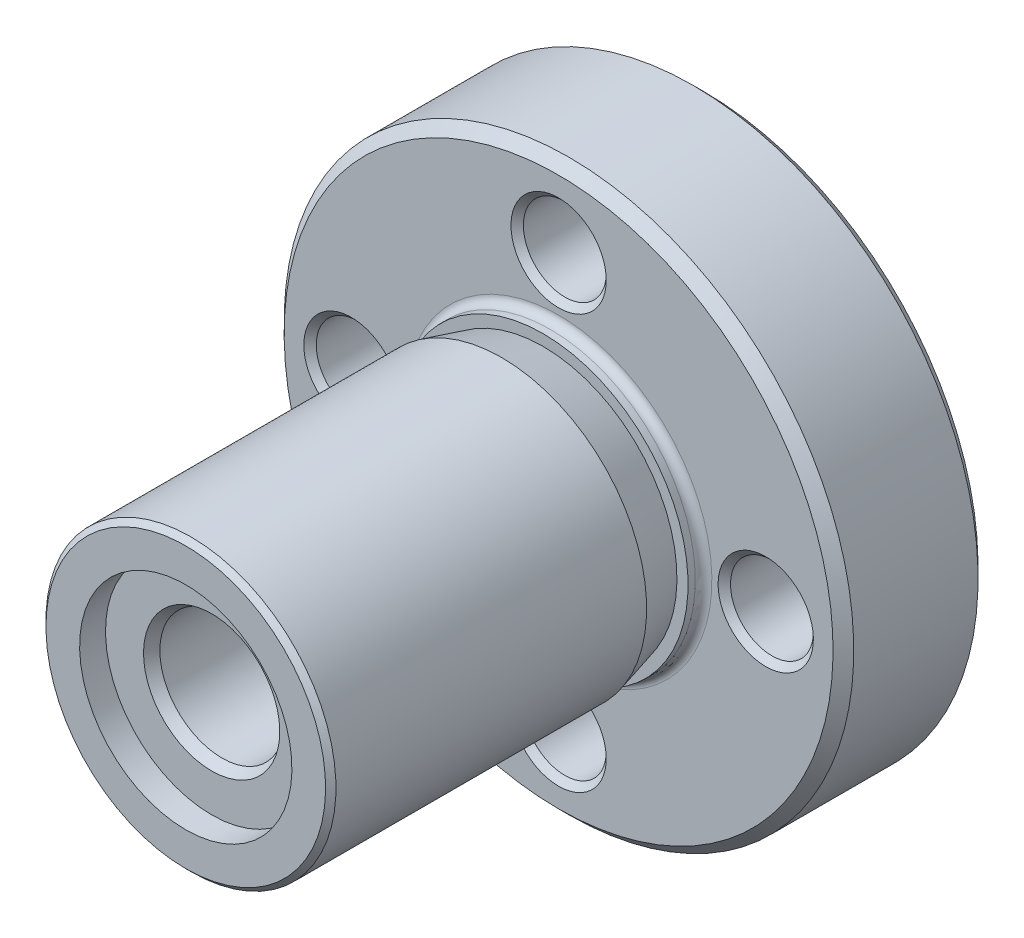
ISO-10303-21;
HEADER;
FILE_DESCRIPTION(('STEP AP214'),'2;1');
FILE_NAME('part.step','',(''),(''),'','','');
FILE_SCHEMA(('AUTOMOTIVE_DESIGN { 1 0 10303 214 1 1 1 1 }'));
ENDSEC;
DATA;
#1=APPLICATION_CONTEXT('core data for automotive mechanical design processes');
#2=APPLICATION_PROTOCOL_DEFINITION('international standard','automotive_design',2000,#1);
#3=PRODUCT_CONTEXT('',#1,'mechanical');
#4=PRODUCT('Part','Part','',(#3));
#5=PRODUCT_RELATED_PRODUCT_CATEGORY('part','',(#4));
#6=PRODUCT_DEFINITION_FORMATION('','',#4);
#7=PRODUCT_DEFINITION_CONTEXT('part definition',#1,'design');
#8=PRODUCT_DEFINITION('design','',#6,#7);
#9=PRODUCT_DEFINITION_SHAPE('','',#8);
#10=(LENGTH_UNIT() NAMED_UNIT(*) SI_UNIT(.MILLI.,.METRE.));
#11=(NAMED_UNIT(*) PLANE_ANGLE_UNIT() SI_UNIT($,.RADIAN.));
#12=(NAMED_UNIT(*) SI_UNIT($,.STERADIAN.) SOLID_ANGLE_UNIT());
#13=UNCERTAINTY_MEASURE_WITH_UNIT(LENGTH_MEASURE(1.E-05),#10,'distance_accuracy_value','');
#14=(GEOMETRIC_REPRESENTATION_CONTEXT(3) GLOBAL_UNCERTAINTY_ASSIGNED_CONTEXT((#13)) GLOBAL_UNIT_ASSIGNED_CONTEXT((#10,
#11,#12)) REPRESENTATION_CONTEXT('',''));
#15=CARTESIAN_POINT('',(0.,0.,0.));
#16=DIRECTION('',(0.,0.,1.));
#17=DIRECTION('',(1.,0.,0.));
#18=AXIS2_PLACEMENT_3D('',#15,#16,#17);
#19=CARTESIAN_POINT('',(0.,0.,0.));
#20=DIRECTION('',(0.,0.,-1.));
#21=DIRECTION('',(0.,1.,0.));
#22=AXIS2_PLACEMENT_3D('',#19,#20,#21);
#23=CYLINDRICAL_SURFACE('',#22,6.);
#24=CARTESIAN_POINT('',(0.,0.,1.));
#25=DIRECTION('',(0.,0.,-1.));
#26=DIRECTION('',(0.,1.,0.));
#27=AXIS2_PLACEMENT_3D('',#24,#25,#26);
#28=CIRCLE('',#27,6.);
#29=CARTESIAN_POINT('',(0.,6.,1.));
#30=VERTEX_POINT('',#29);
#31=EDGE_CURVE('E98',#30,#30,#28,.T.);
#32=ORIENTED_EDGE('',*,*,#31,.T.);
#33=EDGE_LOOP('',(#32));
#34=FACE_BOUND('',#33,.T.);
#35=CARTESIAN_POINT('',(0.,0.,46.5));
#36=DIRECTION('',(0.,0.,1.));
#37=DIRECTION('',(0.,-1.,0.));
#38=AXIS2_PLACEMENT_3D('',#35,#36,#37);
#39=CIRCLE('',#38,6.);
#40=CARTESIAN_POINT('',(0.,-6.,46.5));
#41=VERTEX_POINT('',#40);
#42=EDGE_CURVE('E110',#41,#41,#39,.T.);
#43=ORIENTED_EDGE('',*,*,#42,.T.);
#44=EDGE_LOOP('',(#43));
#45=FACE_BOUND('',#44,.T.);
#46=ADVANCED_FACE('F12',(#34,#45),#23,.F.);
#47=CARTESIAN_POINT('',(0.,0.,0.));
#48=DIRECTION('',(0.,0.,-1.));
#49=DIRECTION('',(0.,1.,0.));
#50=AXIS2_PLACEMENT_3D('',#47,#48,#49);
#51=CYLINDRICAL_SURFACE('',#50,14.);
#52=CARTESIAN_POINT('',(0.,0.,14.8));
#53=DIRECTION('',(0.,0.,1.));
#54=DIRECTION('',(0.,-1.,0.));
#55=AXIS2_PLACEMENT_3D('',#52,#53,#54);
#56=CIRCLE('',#55,14.);
#57=CARTESIAN_POINT('',(0.,-14.,14.8));
#58=VERTEX_POINT('',#57);
#59=EDGE_CURVE('E107',#58,#58,#56,.T.);
#60=ORIENTED_EDGE('',*,*,#59,.T.);
#61=EDGE_LOOP('',(#60));
#62=FACE_BOUND('',#61,.T.);
#63=CARTESIAN_POINT('',(0.,0.,15.5));
#64=DIRECTION('',(0.,0.,-1.));
#65=DIRECTION('',(0.,1.,0.));
#66=AXIS2_PLACEMENT_3D('',#63,#64,#65);
#67=CIRCLE('',#66,14.);
#68=CARTESIAN_POINT('',(0.,14.,15.5));
#69=VERTEX_POINT('',#68);
#70=EDGE_CURVE('E77',#69,#69,#67,.T.);
#71=ORIENTED_EDGE('',*,*,#70,.T.);
#72=EDGE_LOOP('',(#71));
#73=FACE_BOUND('',#72,.T.);
#74=ADVANCED_FACE('F144',(#62,#73),#51,.T.);
#75=CARTESIAN_POINT('',(0.,0.,49.5));
#76=DIRECTION('',(0.,0.,1.));
#77=DIRECTION('',(0.,-1.,0.));
#78=AXIS2_PLACEMENT_3D('',#75,#76,#77);
#79=CIRCLE('',#78,14.);
#80=CARTESIAN_POINT('',(0.,-14.,49.5));
#81=VERTEX_POINT('',#80);
#82=EDGE_CURVE('E92',#81,#81,#79,.F.);
#83=ORIENTED_EDGE('',*,*,#82,.T.);
#84=EDGE_LOOP('',(#83));
#85=FACE_BOUND('',#84,.T.);
#86=CARTESIAN_POINT('',(0.,0.,19.5));
#87=DIRECTION('',(0.,0.,-1.));
#88=DIRECTION('',(0.,1.,0.));
#89=AXIS2_PLACEMENT_3D('',#86,#87,#88);
#90=CIRCLE('',#89,14.);
#91=CARTESIAN_POINT('',(0.,14.,19.5));
#92=VERTEX_POINT('',#91);
#93=EDGE_CURVE('E74',#92,#92,#90,.T.);
#94=ORIENTED_EDGE('',*,*,#93,.F.);
#95=EDGE_LOOP('',(#94));
#96=FACE_BOUND('',#95,.T.);
#97=ADVANCED_FACE('F150',(#85,#96),#51,.T.);
#98=CARTESIAN_POINT('',(6.,0.,0.));
#99=DIRECTION('',(0.,0.,-1.));
#100=DIRECTION('',(0.,1.,0.));
#101=AXIS2_PLACEMENT_3D('',#98,#99,#100);
#102=PLANE('',#101);
#103=CARTESIAN_POINT('',(0.,0.,0.));
#104=DIRECTION('',(0.,0.,-1.));
#105=DIRECTION('',(0.,1.,0.));
#106=AXIS2_PLACEMENT_3D('',#103,#104,#105);
#107=CIRCLE('',#106,6.57735026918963);
#108=CARTESIAN_POINT('',(0.,6.57735026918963,0.));
#109=VERTEX_POINT('',#108);
#110=EDGE_CURVE('E101',#109,#109,#107,.F.);
#111=ORIENTED_EDGE('',*,*,#110,.T.);
#112=EDGE_LOOP('',(#111));
#113=FACE_BOUND('',#112,.T.);
#114=CARTESIAN_POINT('',(0.,0.,0.));
#115=DIRECTION('',(0.,0.,-1.));
#116=DIRECTION('',(0.,1.,0.));
#117=AXIS2_PLACEMENT_3D('',#114,#115,#116);
#118=CIRCLE('',#117,26.5);
#119=CARTESIAN_POINT('',(0.,26.5,0.));
#120=VERTEX_POINT('',#119);
#121=EDGE_CURVE('E89',#120,#120,#118,.T.);
#122=ORIENTED_EDGE('',*,*,#121,.T.);
#123=EDGE_LOOP('',(#122));
#124=FACE_BOUND('',#123,.T.);
#125=CARTESIAN_POINT('',(20.,0.,0.));
#126=DIRECTION('',(0.,0.,-1.));
#127=DIRECTION('',(0.,1.,0.));
#128=AXIS2_PLACEMENT_3D('',#125,#126,#127);
#129=CIRCLE('',#128,4.6);
#130=CARTESIAN_POINT('',(20.,4.6,0.));
#131=VERTEX_POINT('',#130);
#132=EDGE_CURVE('E59',#131,#131,#129,.T.);
#133=ORIENTED_EDGE('',*,*,#132,.F.);
#134=EDGE_LOOP('',(#133));
#135=FACE_BOUND('',#134,.T.);
#136=CARTESIAN_POINT('',(0.,-20.,0.));
#137=DIRECTION('',(0.,0.,-1.));
#138=DIRECTION('',(0.,1.,0.));
#139=AXIS2_PLACEMENT_3D('',#136,#137,#138);
#140=CIRCLE('',#139,4.6);
#141=CARTESIAN_POINT('',(0.,-15.4,0.));
#142=VERTEX_POINT('',#141);
#143=EDGE_CURVE('E62',#142,#142,#140,.T.);
#144=ORIENTED_EDGE('',*,*,#143,.F.);
#145=EDGE_LOOP('',(#144));
#146=FACE_BOUND('',#145,.T.);
#147=CARTESIAN_POINT('',(-20.,0.,0.));
#148=DIRECTION('',(0.,0.,-1.));
#149=DIRECTION('',(0.,1.,0.));
#150=AXIS2_PLACEMENT_3D('',#147,#148,#149);
#151=CIRCLE('',#150,4.6);
#152=CARTESIAN_POINT('',(-20.,4.6,0.));
#153=VERTEX_POINT('',#152);
#154=EDGE_CURVE('E65',#153,#153,#151,.T.);
#155=ORIENTED_EDGE('',*,*,#154,.F.);
#156=EDGE_LOOP('',(#155));
#157=FACE_BOUND('',#156,.T.);
#158=CARTESIAN_POINT('',(0.,20.,0.));
#159=DIRECTION('',(0.,0.,-1.));
#160=DIRECTION('',(0.,1.,0.));
#161=AXIS2_PLACEMENT_3D('',#158,#159,#160);
#162=CIRCLE('',#161,4.6);
#163=CARTESIAN_POINT('',(0.,24.6,0.));
#164=VERTEX_POINT('',#163);
#165=EDGE_CURVE('E68',#164,#164,#162,.T.);
#166=ORIENTED_EDGE('',*,*,#165,.F.);
#167=EDGE_LOOP('',(#166));
#168=FACE_BOUND('',#167,.T.);
#169=ADVANCED_FACE('F228',(#113,#124,#135,#146,#157,#168),#102,.T.);
#170=CARTESIAN_POINT('',(0.,0.,0.));
#171=DIRECTION('',(0.,0.,-1.));
#172=DIRECTION('',(0.,1.,0.));
#173=AXIS2_PLACEMENT_3D('',#170,#171,#172);
#174=CYLINDRICAL_SURFACE('',#173,27.5);
#175=CARTESIAN_POINT('',(0.,0.,13.));
#176=DIRECTION('',(0.,0.,1.));
#177=DIRECTION('',(0.,-1.,0.));
#178=AXIS2_PLACEMENT_3D('',#175,#176,#177);
#179=CIRCLE('',#178,27.5);
#180=CARTESIAN_POINT('',(0.,-27.5,13.));
#181=VERTEX_POINT('',#180);
#182=EDGE_CURVE('E83',#181,#181,#179,.F.);
#183=ORIENTED_EDGE('',*,*,#182,.T.);
#184=EDGE_LOOP('',(#183));
#185=FACE_BOUND('',#184,.T.);
#186=CARTESIAN_POINT('',(0.,0.,1.));
#187=DIRECTION('',(0.,0.,-1.));
#188=DIRECTION('',(0.,1.,0.));
#189=AXIS2_PLACEMENT_3D('',#186,#187,#188);
#190=CIRCLE('',#189,27.5);
#191=CARTESIAN_POINT('',(0.,27.5,1.));
#192=VERTEX_POINT('',#191);
#193=EDGE_CURVE('E80',#192,#192,#190,.F.);
#194=ORIENTED_EDGE('',*,*,#193,.T.);
#195=EDGE_LOOP('',(#194));
#196=FACE_BOUND('',#195,.T.);
#197=ADVANCED_FACE('F226',(#185,#196),#174,.T.);
#198=CARTESIAN_POINT('',(14.,0.,14.));
#199=DIRECTION('',(0.,0.,1.));
#200=DIRECTION('',(0.,-1.,0.));
#201=AXIS2_PLACEMENT_3D('',#198,#199,#200);
#202=PLANE('',#201);
#203=CARTESIAN_POINT('',(-20.,0.,14.));
#204=DIRECTION('',(0.,0.,1.));
#205=DIRECTION('',(0.,-1.,0.));
#206=AXIS2_PLACEMENT_3D('',#203,#204,#205);
#207=CIRCLE('',#206,4.6);
#208=CARTESIAN_POINT('',(-20.,-4.6,14.));
#209=VERTEX_POINT('',#208);
#210=EDGE_CURVE('E8',#209,#209,#207,.F.);
#211=ORIENTED_EDGE('',*,*,#210,.T.);
#212=EDGE_LOOP('',(#211));
#213=FACE_BOUND('',#212,.T.);
#214=CARTESIAN_POINT('',(20.,0.,14.));
#215=DIRECTION('',(0.,0.,1.));
#216=DIRECTION('',(0.,-1.,0.));
#217=AXIS2_PLACEMENT_3D('',#214,#215,#216);
#218=CIRCLE('',#217,4.6);
#219=CARTESIAN_POINT('',(20.,-4.6,14.));
#220=VERTEX_POINT('',#219);
#221=EDGE_CURVE('E19',#220,#220,#218,.F.);
#222=ORIENTED_EDGE('',*,*,#221,.T.);
#223=EDGE_LOOP('',(#222));
#224=FACE_BOUND('',#223,.T.);
#225=CARTESIAN_POINT('',(0.,20.,14.));
#226=DIRECTION('',(0.,0.,1.));
#227=DIRECTION('',(0.,-1.,0.));
#228=AXIS2_PLACEMENT_3D('',#225,#226,#227);
#229=CIRCLE('',#228,4.6);
#230=CARTESIAN_POINT('',(0.,15.4,14.));
#231=VERTEX_POINT('',#230);
#232=EDGE_CURVE('E24',#231,#231,#229,.F.);
#233=ORIENTED_EDGE('',*,*,#232,.T.);
#234=EDGE_LOOP('',(#233));
#235=FACE_BOUND('',#234,.T.);
#236=CARTESIAN_POINT('',(0.,-20.,14.));
#237=DIRECTION('',(0.,0.,1.));
#238=DIRECTION('',(0.,-1.,0.));
#239=AXIS2_PLACEMENT_3D('',#236,#237,#238);
#240=CIRCLE('',#239,4.6);
#241=CARTESIAN_POINT('',(0.,-24.6,14.));
#242=VERTEX_POINT('',#241);
#243=EDGE_CURVE('E116',#242,#242,#240,.F.);
#244=ORIENTED_EDGE('',*,*,#243,.T.);
#245=EDGE_LOOP('',(#244));
#246=FACE_BOUND('',#245,.T.);
#247=CARTESIAN_POINT('',(0.,0.,14.));
#248=DIRECTION('',(0.,0.,1.));
#249=DIRECTION('',(0.,-1.,0.));
#250=AXIS2_PLACEMENT_3D('',#247,#248,#249);
#251=CIRCLE('',#250,14.8);
#252=CARTESIAN_POINT('',(0.,-14.8,14.));
#253=VERTEX_POINT('',#252);
#254=EDGE_CURVE('E104',#253,#253,#251,.F.);
#255=ORIENTED_EDGE('',*,*,#254,.T.);
#256=EDGE_LOOP('',(#255));
#257=FACE_BOUND('',#256,.T.);
#258=CARTESIAN_POINT('',(0.,0.,14.));
#259=DIRECTION('',(0.,0.,1.));
#260=DIRECTION('',(0.,-1.,0.));
#261=AXIS2_PLACEMENT_3D('',#258,#259,#260);
#262=CIRCLE('',#261,26.5);
#263=CARTESIAN_POINT('',(0.,-26.5,14.));
#264=VERTEX_POINT('',#263);
#265=EDGE_CURVE('E86',#264,#264,#262,.T.);
#266=ORIENTED_EDGE('',*,*,#265,.T.);
#267=EDGE_LOOP('',(#266));
#268=FACE_BOUND('',#267,.T.);
#269=ADVANCED_FACE('F121',(#213,#224,#235,#246,#257,#268),#202,.T.);
#270=CARTESIAN_POINT('',(6.,0.,50.));
#271=DIRECTION('',(0.,0.,1.));
#272=DIRECTION('',(0.,-1.,0.));
#273=AXIS2_PLACEMENT_3D('',#270,#271,#272);
#274=PLANE('',#273);
#275=CARTESIAN_POINT('',(0.,0.,50.));
#276=DIRECTION('',(0.,0.,1.));
#277=DIRECTION('',(0.,-1.,0.));
#278=AXIS2_PLACEMENT_3D('',#275,#276,#277);
#279=CIRCLE('',#278,13.5);
#280=CARTESIAN_POINT('',(0.,-13.5,50.));
#281=VERTEX_POINT('',#280);
#282=EDGE_CURVE('E95',#281,#281,#279,.T.);
#283=ORIENTED_EDGE('',*,*,#282,.T.);
#284=EDGE_LOOP('',(#283));
#285=FACE_BOUND('',#284,.T.);
#286=CARTESIAN_POINT('',(0.,0.,50.));
#287=DIRECTION('',(0.,0.,1.));
#288=DIRECTION('',(0.,-1.,0.));
#289=AXIS2_PLACEMENT_3D('',#286,#287,#288);
#290=CIRCLE('',#289,10.25);
#291=CARTESIAN_POINT('',(0.,-10.25,50.));
#292=VERTEX_POINT('',#291);
#293=EDGE_CURVE('E53',#292,#292,#290,.T.);
#294=ORIENTED_EDGE('',*,*,#293,.F.);
#295=EDGE_LOOP('',(#294));
#296=FACE_BOUND('',#295,.T.);
#297=ADVANCED_FACE('F219',(#285,#296),#274,.T.);
#298=CARTESIAN_POINT('',(-14.,0.,15.5));
#299=DIRECTION('',(0.,0.,1.));
#300=DIRECTION('',(0.,-1.,0.));
#301=AXIS2_PLACEMENT_3D('',#298,#299,#300);
#302=PLANE('',#301);
#303=CARTESIAN_POINT('',(0.,0.,15.5));
#304=DIRECTION('',(0.,0.,-1.));
#305=DIRECTION('',(0.,1.,0.));
#306=AXIS2_PLACEMENT_3D('',#303,#304,#305);
#307=CIRCLE('',#306,12.9282032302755);
#308=CARTESIAN_POINT('',(0.,12.9282032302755,15.5));
#309=VERTEX_POINT('',#308);
#310=EDGE_CURVE('E71',#309,#309,#307,.T.);
#311=ORIENTED_EDGE('',*,*,#310,.T.);
#312=EDGE_LOOP('',(#311));
#313=FACE_BOUND('',#312,.T.);
#314=ORIENTED_EDGE('',*,*,#70,.F.);
#315=EDGE_LOOP('',(#314));
#316=FACE_BOUND('',#315,.T.);
#317=ADVANCED_FACE('F215',(#313,#316),#302,.T.);
#318=CARTESIAN_POINT('',(0.,0.,15.5));
#319=DIRECTION('',(0.,0.,1.));
#320=DIRECTION('',(0.,-1.,0.));
#321=AXIS2_PLACEMENT_3D('',#318,#319,#320);
#322=CONICAL_SURFACE('',#321,12.9282032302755,0.261799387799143);
#323=ORIENTED_EDGE('',*,*,#310,.F.);
#324=EDGE_LOOP('',(#323));
#325=FACE_BOUND('',#324,.T.);
#326=ORIENTED_EDGE('',*,*,#93,.T.);
#327=EDGE_LOOP('',(#326));
#328=FACE_BOUND('',#327,.T.);
#329=ADVANCED_FACE('F212',(#325,#328),#322,.T.);
#330=CARTESIAN_POINT('',(0.,20.,0.));
#331=DIRECTION('',(0.,0.,-1.));
#332=DIRECTION('',(0.,1.,0.));
#333=AXIS2_PLACEMENT_3D('',#330,#331,#332);
#334=CONICAL_SURFACE('',#333,4.6,0.785398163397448);
#335=CARTESIAN_POINT('',(0.,20.,0.6));
#336=DIRECTION('',(0.,0.,-1.));
#337=DIRECTION('',(0.,1.,0.));
#338=AXIS2_PLACEMENT_3D('',#335,#336,#337);
#339=CIRCLE('',#338,4.);
#340=CARTESIAN_POINT('',(0.,24.,0.6));
#341=VERTEX_POINT('',#340);
#342=EDGE_CURVE('E38',#341,#341,#339,.F.);
#343=ORIENTED_EDGE('',*,*,#342,.T.);
#344=EDGE_LOOP('',(#343));
#345=FACE_BOUND('',#344,.T.);
#346=ORIENTED_EDGE('',*,*,#165,.T.);
#347=EDGE_LOOP('',(#346));
#348=FACE_BOUND('',#347,.T.);
#349=ADVANCED_FACE('F208',(#345,#348),#334,.F.);
#350=CARTESIAN_POINT('',(-20.,0.,0.));
#351=DIRECTION('',(0.,0.,-1.));
#352=DIRECTION('',(0.,1.,0.));
#353=AXIS2_PLACEMENT_3D('',#350,#351,#352);
#354=CONICAL_SURFACE('',#353,4.6,0.785398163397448);
#355=CARTESIAN_POINT('',(-20.,0.,0.6));
#356=DIRECTION('',(0.,0.,-1.));
#357=DIRECTION('',(0.,1.,0.));
#358=AXIS2_PLACEMENT_3D('',#355,#356,#357);
#359=CIRCLE('',#358,4.);
#360=CARTESIAN_POINT('',(-20.,4.,0.6));
#361=VERTEX_POINT('',#360);
#362=EDGE_CURVE('E31',#361,#361,#359,.F.);
#363=ORIENTED_EDGE('',*,*,#362,.T.);
#364=EDGE_LOOP('',(#363));
#365=FACE_BOUND('',#364,.T.);
#366=ORIENTED_EDGE('',*,*,#154,.T.);
#367=EDGE_LOOP('',(#366));
#368=FACE_BOUND('',#367,.T.);
#369=ADVANCED_FACE('F204',(#365,#368),#354,.F.);
#370=CARTESIAN_POINT('',(0.,-20.,0.));
#371=DIRECTION('',(0.,0.,-1.));
#372=DIRECTION('',(0.,1.,0.));
#373=AXIS2_PLACEMENT_3D('',#370,#371,#372);
#374=CONICAL_SURFACE('',#373,4.6,0.785398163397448);
#375=CARTESIAN_POINT('',(0.,-20.,0.6));
#376=DIRECTION('',(0.,0.,-1.));
#377=DIRECTION('',(0.,1.,0.));
#378=AXIS2_PLACEMENT_3D('',#375,#376,#377);
#379=CIRCLE('',#378,4.);
#380=CARTESIAN_POINT('',(0.,-16.,0.6));
#381=VERTEX_POINT('',#380);
#382=EDGE_CURVE('E32',#381,#381,#379,.F.);
#383=ORIENTED_EDGE('',*,*,#382,.T.);
#384=EDGE_LOOP('',(#383));
#385=FACE_BOUND('',#384,.T.);
#386=ORIENTED_EDGE('',*,*,#143,.T.);
#387=EDGE_LOOP('',(#386));
#388=FACE_BOUND('',#387,.T.);
#389=ADVANCED_FACE('F200',(#385,#388),#374,.F.);
#390=CARTESIAN_POINT('',(20.,0.,0.));
#391=DIRECTION('',(0.,0.,-1.));
#392=DIRECTION('',(0.,1.,0.));
#393=AXIS2_PLACEMENT_3D('',#390,#391,#392);
#394=CONICAL_SURFACE('',#393,4.6,0.785398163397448);
#395=CARTESIAN_POINT('',(20.,0.,0.6));
#396=DIRECTION('',(0.,0.,-1.));
#397=DIRECTION('',(0.,1.,0.));
#398=AXIS2_PLACEMENT_3D('',#395,#396,#397);
#399=CIRCLE('',#398,4.);
#400=CARTESIAN_POINT('',(20.,4.,0.6));
#401=VERTEX_POINT('',#400);
#402=EDGE_CURVE('E35',#401,#401,#399,.F.);
#403=ORIENTED_EDGE('',*,*,#402,.T.);
#404=EDGE_LOOP('',(#403));
#405=FACE_BOUND('',#404,.T.);
#406=ORIENTED_EDGE('',*,*,#132,.T.);
#407=EDGE_LOOP('',(#406));
#408=FACE_BOUND('',#407,.T.);
#409=ADVANCED_FACE('F196',(#405,#408),#394,.F.);
#410=CARTESIAN_POINT('',(0.,0.,47.5));
#411=DIRECTION('',(0.,0.,1.));
#412=DIRECTION('',(0.,-1.,0.));
#413=AXIS2_PLACEMENT_3D('',#410,#411,#412);
#414=CYLINDRICAL_SURFACE('',#413,10.25);
#415=CARTESIAN_POINT('',(0.,0.,47.5));
#416=DIRECTION('',(0.,0.,1.));
#417=DIRECTION('',(0.,-1.,0.));
#418=AXIS2_PLACEMENT_3D('',#415,#416,#417);
#419=CIRCLE('',#418,10.25);
#420=CARTESIAN_POINT('',(0.,-10.25,47.5));
#421=VERTEX_POINT('',#420);
#422=EDGE_CURVE('E56',#421,#421,#419,.T.);
#423=ORIENTED_EDGE('',*,*,#422,.F.);
#424=EDGE_LOOP('',(#423));
#425=FACE_BOUND('',#424,.T.);
#426=ORIENTED_EDGE('',*,*,#293,.T.);
#427=EDGE_LOOP('',(#426));
#428=FACE_BOUND('',#427,.T.);
#429=ADVANCED_FACE('F192',(#425,#428),#414,.F.);
#430=CARTESIAN_POINT('',(0.,0.,47.5));
#431=DIRECTION('',(0.,0.,1.));
#432=DIRECTION('',(0.,-1.,0.));
#433=AXIS2_PLACEMENT_3D('',#430,#431,#432);
#434=PLANE('',#433);
#435=CARTESIAN_POINT('',(0.,0.,47.5));
#436=DIRECTION('',(0.,0.,1.));
#437=DIRECTION('',(0.,-1.,0.));
#438=AXIS2_PLACEMENT_3D('',#435,#436,#437);
#439=CIRCLE('',#438,6.57735026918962);
#440=CARTESIAN_POINT('',(0.,-6.57735026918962,47.5));
#441=VERTEX_POINT('',#440);
#442=EDGE_CURVE('E113',#441,#441,#439,.F.);
#443=ORIENTED_EDGE('',*,*,#442,.T.);
#444=EDGE_LOOP('',(#443));
#445=FACE_BOUND('',#444,.T.);
#446=ORIENTED_EDGE('',*,*,#422,.T.);
#447=EDGE_LOOP('',(#446));
#448=FACE_BOUND('',#447,.T.);
#449=ADVANCED_FACE('F188',(#445,#448),#434,.T.);
#450=CARTESIAN_POINT('',(0.,0.,13.));
#451=DIRECTION('',(0.,0.,-1.));
#452=DIRECTION('',(0.,1.,0.));
#453=AXIS2_PLACEMENT_3D('',#450,#451,#452);
#454=CONICAL_SURFACE('',#453,27.5,0.785398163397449);
#455=ORIENTED_EDGE('',*,*,#265,.F.);
#456=EDGE_LOOP('',(#455));
#457=FACE_BOUND('',#456,.T.);
#458=ORIENTED_EDGE('',*,*,#182,.F.);
#459=EDGE_LOOP('',(#458));
#460=FACE_BOUND('',#459,.T.);
#461=ADVANCED_FACE('F184',(#457,#460),#454,.T.);
#462=CARTESIAN_POINT('',(0.,0.,0.));
#463=DIRECTION('',(0.,0.,1.));
#464=DIRECTION('',(0.,-1.,0.));
#465=AXIS2_PLACEMENT_3D('',#462,#463,#464);
#466=CONICAL_SURFACE('',#465,26.5,0.785398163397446);
#467=ORIENTED_EDGE('',*,*,#193,.F.);
#468=EDGE_LOOP('',(#467));
#469=FACE_BOUND('',#468,.T.);
#470=ORIENTED_EDGE('',*,*,#121,.F.);
#471=EDGE_LOOP('',(#470));
#472=FACE_BOUND('',#471,.T.);
#473=ADVANCED_FACE('F180',(#469,#472),#466,.T.);
#474=CARTESIAN_POINT('',(0.,0.,49.5));
#475=DIRECTION('',(0.,0.,-1.));
#476=DIRECTION('',(0.,1.,0.));
#477=AXIS2_PLACEMENT_3D('',#474,#475,#476);
#478=CONICAL_SURFACE('',#477,14.,0.785398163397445);
#479=ORIENTED_EDGE('',*,*,#282,.F.);
#480=EDGE_LOOP('',(#479));
#481=FACE_BOUND('',#480,.T.);
#482=ORIENTED_EDGE('',*,*,#82,.F.);
#483=EDGE_LOOP('',(#482));
#484=FACE_BOUND('',#483,.T.);
#485=ADVANCED_FACE('F176',(#481,#484),#478,.T.);
#486=CARTESIAN_POINT('',(0.,0.,1.));
#487=DIRECTION('',(0.,0.,-1.));
#488=DIRECTION('',(0.,1.,0.));
#489=AXIS2_PLACEMENT_3D('',#486,#487,#488);
#490=CONICAL_SURFACE('',#489,6.,0.523598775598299);
#491=ORIENTED_EDGE('',*,*,#110,.F.);
#492=EDGE_LOOP('',(#491));
#493=FACE_BOUND('',#492,.T.);
#494=ORIENTED_EDGE('',*,*,#31,.F.);
#495=EDGE_LOOP('',(#494));
#496=FACE_BOUND('',#495,.T.);
#497=ADVANCED_FACE('F169',(#493,#496),#490,.F.);
#498=CARTESIAN_POINT('',(0.,0.,14.8));
#499=DIRECTION('',(0.,0.,1.));
#500=DIRECTION('',(0.,-1.,0.));
#501=AXIS2_PLACEMENT_3D('',#498,#499,#500);
#502=TOROIDAL_SURFACE('',#501,14.8,0.8);
#503=ORIENTED_EDGE('',*,*,#59,.F.);
#504=EDGE_LOOP('',(#503));
#505=FACE_BOUND('',#504,.T.);
#506=ORIENTED_EDGE('',*,*,#254,.F.);
#507=EDGE_LOOP('',(#506));
#508=FACE_BOUND('',#507,.T.);
#509=ADVANCED_FACE('F159',(#505,#508),#502,.F.);
#510=CARTESIAN_POINT('',(0.,0.,46.5));
#511=DIRECTION('',(0.,0.,1.));
#512=DIRECTION('',(0.,-1.,0.));
#513=AXIS2_PLACEMENT_3D('',#510,#511,#512);
#514=CONICAL_SURFACE('',#513,6.,0.523598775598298);
#515=ORIENTED_EDGE('',*,*,#442,.F.);
#516=EDGE_LOOP('',(#515));
#517=FACE_BOUND('',#516,.T.);
#518=ORIENTED_EDGE('',*,*,#42,.F.);
#519=EDGE_LOOP('',(#518));
#520=FACE_BOUND('',#519,.T.);
#521=ADVANCED_FACE('F157',(#517,#520),#514,.F.);
#522=CARTESIAN_POINT('',(-20.,0.,12.8));
#523=DIRECTION('',(0.,0.,1.));
#524=DIRECTION('',(0.,-1.,0.));
#525=AXIS2_PLACEMENT_3D('',#522,#523,#524);
#526=CONICAL_SURFACE('',#525,3.4,0.785398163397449);
#527=CARTESIAN_POINT('',(-20.,0.,13.4));
#528=DIRECTION('',(0.,0.,1.));
#529=DIRECTION('',(0.,-1.,0.));
#530=AXIS2_PLACEMENT_3D('',#527,#528,#529);
#531=CIRCLE('',#530,4.);
#532=CARTESIAN_POINT('',(-20.,-4.,13.4));
#533=VERTEX_POINT('',#532);
#534=EDGE_CURVE('E28',#533,#533,#531,.T.);
#535=ORIENTED_EDGE('',*,*,#534,.F.);
#536=EDGE_LOOP('',(#535));
#537=FACE_BOUND('',#536,.T.);
#538=ORIENTED_EDGE('',*,*,#210,.F.);
#539=EDGE_LOOP('',(#538));
#540=FACE_BOUND('',#539,.T.);
#541=ADVANCED_FACE('F139',(#537,#540),#526,.F.);
#542=CARTESIAN_POINT('',(20.,0.,12.8));
#543=DIRECTION('',(0.,0.,1.));
#544=DIRECTION('',(0.,-1.,0.));
#545=AXIS2_PLACEMENT_3D('',#542,#543,#544);
#546=CONICAL_SURFACE('',#545,3.4,0.785398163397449);
#547=CARTESIAN_POINT('',(20.,0.,13.4));
#548=DIRECTION('',(0.,0.,1.));
#549=DIRECTION('',(0.,-1.,0.));
#550=AXIS2_PLACEMENT_3D('',#547,#548,#549);
#551=CIRCLE('',#550,4.);
#552=CARTESIAN_POINT('',(20.,-4.,13.4));
#553=VERTEX_POINT('',#552);
#554=EDGE_CURVE('E36',#553,#553,#551,.T.);
#555=ORIENTED_EDGE('',*,*,#554,.F.);
#556=EDGE_LOOP('',(#555));
#557=FACE_BOUND('',#556,.T.);
#558=ORIENTED_EDGE('',*,*,#221,.F.);
#559=EDGE_LOOP('',(#558));
#560=FACE_BOUND('',#559,.T.);
#561=ADVANCED_FACE('F127',(#557,#560),#546,.F.);
#562=CARTESIAN_POINT('',(0.,20.,12.8));
#563=DIRECTION('',(0.,0.,1.));
#564=DIRECTION('',(0.,-1.,0.));
#565=AXIS2_PLACEMENT_3D('',#562,#563,#564);
#566=CONICAL_SURFACE('',#565,3.4,0.785398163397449);
#567=CARTESIAN_POINT('',(0.,20.,13.4));
#568=DIRECTION('',(0.,0.,1.));
#569=DIRECTION('',(0.,-1.,0.));
#570=AXIS2_PLACEMENT_3D('',#567,#568,#569);
#571=CIRCLE('',#570,4.);
#572=CARTESIAN_POINT('',(0.,16.,13.4));
#573=VERTEX_POINT('',#572);
#574=EDGE_CURVE('E15',#573,#573,#571,.T.);
#575=ORIENTED_EDGE('',*,*,#574,.F.);
#576=EDGE_LOOP('',(#575));
#577=FACE_BOUND('',#576,.T.);
#578=ORIENTED_EDGE('',*,*,#232,.F.);
#579=EDGE_LOOP('',(#578));
#580=FACE_BOUND('',#579,.T.);
#581=ADVANCED_FACE('F124',(#577,#580),#566,.F.);
#582=CARTESIAN_POINT('',(0.,-20.,12.8));
#583=DIRECTION('',(0.,0.,1.));
#584=DIRECTION('',(0.,-1.,0.));
#585=AXIS2_PLACEMENT_3D('',#582,#583,#584);
#586=CONICAL_SURFACE('',#585,3.4,0.785398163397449);
#587=CARTESIAN_POINT('',(0.,-20.,13.4));
#588=DIRECTION('',(0.,0.,1.));
#589=DIRECTION('',(0.,-1.,0.));
#590=AXIS2_PLACEMENT_3D('',#587,#588,#589);
#591=CIRCLE('',#590,4.);
#592=CARTESIAN_POINT('',(0.,-24.,13.4));
#593=VERTEX_POINT('',#592);
#594=EDGE_CURVE('E33',#593,#593,#591,.T.);
#595=ORIENTED_EDGE('',*,*,#594,.F.);
#596=EDGE_LOOP('',(#595));
#597=FACE_BOUND('',#596,.T.);
#598=ORIENTED_EDGE('',*,*,#243,.F.);
#599=EDGE_LOOP('',(#598));
#600=FACE_BOUND('',#599,.T.);
#601=ADVANCED_FACE('F126',(#597,#600),#586,.F.);
#602=CARTESIAN_POINT('',(-20.,0.,20.));
#603=DIRECTION('',(0.,0.,-1.));
#604=DIRECTION('',(0.,1.,0.));
#605=AXIS2_PLACEMENT_3D('',#602,#603,#604);
#606=CYLINDRICAL_SURFACE('',#605,4.);
#607=ORIENTED_EDGE('',*,*,#534,.T.);
#608=EDGE_LOOP('',(#607));
#609=FACE_BOUND('',#608,.T.);
#610=ORIENTED_EDGE('',*,*,#362,.F.);
#611=EDGE_LOOP('',(#610));
#612=FACE_BOUND('',#611,.T.);
#613=ADVANCED_FACE('F136',(#609,#612),#606,.F.);
#614=CARTESIAN_POINT('',(0.,-20.,20.));
#615=DIRECTION('',(0.,0.,-1.));
#616=DIRECTION('',(0.,1.,0.));
#617=AXIS2_PLACEMENT_3D('',#614,#615,#616);
#618=CYLINDRICAL_SURFACE('',#617,4.);
#619=ORIENTED_EDGE('',*,*,#594,.T.);
#620=EDGE_LOOP('',(#619));
#621=FACE_BOUND('',#620,.T.);
#622=ORIENTED_EDGE('',*,*,#382,.F.);
#623=EDGE_LOOP('',(#622));
#624=FACE_BOUND('',#623,.T.);
#625=ADVANCED_FACE('F409',(#621,#624),#618,.F.);
#626=CARTESIAN_POINT('',(20.,0.,20.));
#627=DIRECTION('',(0.,0.,-1.));
#628=DIRECTION('',(0.,1.,0.));
#629=AXIS2_PLACEMENT_3D('',#626,#627,#628);
#630=CYLINDRICAL_SURFACE('',#629,4.);
#631=ORIENTED_EDGE('',*,*,#554,.T.);
#632=EDGE_LOOP('',(#631));
#633=FACE_BOUND('',#632,.T.);
#634=ORIENTED_EDGE('',*,*,#402,.F.);
#635=EDGE_LOOP('',(#634));
#636=FACE_BOUND('',#635,.T.);
#637=ADVANCED_FACE('F417',(#633,#636),#630,.F.);
#638=CARTESIAN_POINT('',(0.,20.,20.));
#639=DIRECTION('',(0.,0.,-1.));
#640=DIRECTION('',(0.,1.,0.));
#641=AXIS2_PLACEMENT_3D('',#638,#639,#640);
#642=CYLINDRICAL_SURFACE('',#641,4.);
#643=ORIENTED_EDGE('',*,*,#574,.T.);
#644=EDGE_LOOP('',(#643));
#645=FACE_BOUND('',#644,.T.);
#646=ORIENTED_EDGE('',*,*,#342,.F.);
#647=EDGE_LOOP('',(#646));
#648=FACE_BOUND('',#647,.T.);
#649=ADVANCED_FACE('F426',(#645,#648),#642,.F.);
#650=CLOSED_SHELL('',(#46,#74,#97,#169,#197,#269,#297,#317,#329,#349,#369,#389,#409,#429,#449,
#461,#473,#485,#497,#509,#521,#541,#561,#581,#601,#613,#625,#637,#649));
#651=MANIFOLD_SOLID_BREP('B1',#650);
#652=ADVANCED_BREP_SHAPE_REPRESENTATION('',(#18,#651),#14);
#653=SHAPE_DEFINITION_REPRESENTATION(#9,#652);
ENDSEC;
END-ISO-10303-21;
